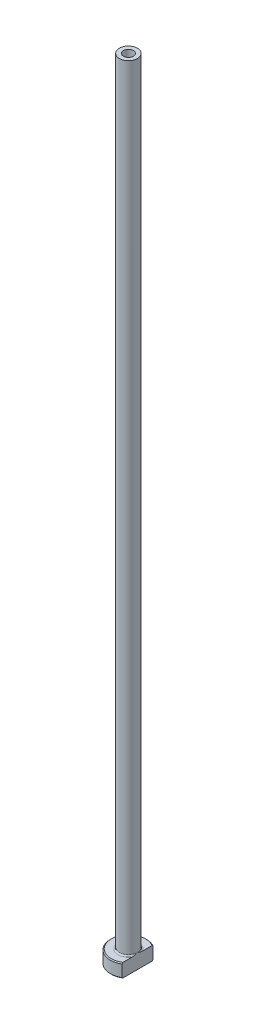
ISO-10303-21;
HEADER;
FILE_DESCRIPTION(('STEP AP214'),'2;1');
FILE_NAME('part.step','',(''),(''),'','','');
FILE_SCHEMA(('AUTOMOTIVE_DESIGN { 1 0 10303 214 1 1 1 1 }'));
ENDSEC;
DATA;
#1=APPLICATION_CONTEXT('core data for automotive mechanical design processes');
#2=APPLICATION_PROTOCOL_DEFINITION('international standard','automotive_design',2000,#1);
#3=PRODUCT_CONTEXT('',#1,'mechanical');
#4=PRODUCT('Part','Part','',(#3));
#5=PRODUCT_RELATED_PRODUCT_CATEGORY('part','',(#4));
#6=PRODUCT_DEFINITION_FORMATION('','',#4);
#7=PRODUCT_DEFINITION_CONTEXT('part definition',#1,'design');
#8=PRODUCT_DEFINITION('design','',#6,#7);
#9=PRODUCT_DEFINITION_SHAPE('','',#8);
#10=(LENGTH_UNIT() NAMED_UNIT(*) SI_UNIT(.MILLI.,.METRE.));
#11=(NAMED_UNIT(*) PLANE_ANGLE_UNIT() SI_UNIT($,.RADIAN.));
#12=(NAMED_UNIT(*) SI_UNIT($,.STERADIAN.) SOLID_ANGLE_UNIT());
#13=UNCERTAINTY_MEASURE_WITH_UNIT(LENGTH_MEASURE(1.E-05),#10,'distance_accuracy_value','');
#14=(GEOMETRIC_REPRESENTATION_CONTEXT(3) GLOBAL_UNCERTAINTY_ASSIGNED_CONTEXT((#13)) GLOBAL_UNIT_ASSIGNED_CONTEXT((#10,
#11,#12)) REPRESENTATION_CONTEXT('',''));
#15=CARTESIAN_POINT('',(0.,0.,0.));
#16=DIRECTION('',(0.,0.,1.));
#17=DIRECTION('',(1.,0.,0.));
#18=AXIS2_PLACEMENT_3D('',#15,#16,#17);
#19=CARTESIAN_POINT('',(0.,92.1876809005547,0.));
#20=DIRECTION('',(0.,1.,0.));
#21=DIRECTION('',(0.,0.,1.));
#22=AXIS2_PLACEMENT_3D('',#19,#20,#21);
#23=CYLINDRICAL_SURFACE('',#22,1.1);
#24=CARTESIAN_POINT('',(0.,175.,0.));
#25=DIRECTION('',(0.,1.,0.));
#26=DIRECTION('',(0.,0.,1.));
#27=AXIS2_PLACEMENT_3D('',#24,#25,#26);
#28=CIRCLE('',#27,1.1);
#29=CARTESIAN_POINT('',(0.,175.,1.1));
#30=VERTEX_POINT('',#29);
#31=EDGE_CURVE('E167',#30,#30,#28,.T.);
#32=ORIENTED_EDGE('',*,*,#31,.T.);
#33=EDGE_LOOP('',(#32));
#34=FACE_BOUND('',#33,.T.);
#35=CARTESIAN_POINT('',(0.,140.,0.));
#36=DIRECTION('',(0.,1.,0.));
#37=DIRECTION('',(0.,0.,1.));
#38=AXIS2_PLACEMENT_3D('',#35,#36,#37);
#39=CIRCLE('',#38,1.1);
#40=CARTESIAN_POINT('',(0.,140.,1.1));
#41=VERTEX_POINT('',#40);
#42=EDGE_CURVE('E170',#41,#41,#39,.T.);
#43=ORIENTED_EDGE('',*,*,#42,.F.);
#44=EDGE_LOOP('',(#43));
#45=FACE_BOUND('',#44,.T.);
#46=ADVANCED_FACE('F32',(#34,#45),#23,.F.);
#47=CARTESIAN_POINT('',(-1.1,175.,0.));
#48=DIRECTION('',(0.,1.,0.));
#49=DIRECTION('',(0.,0.,1.));
#50=AXIS2_PLACEMENT_3D('',#47,#48,#49);
#51=PLANE('',#50);
#52=CARTESIAN_POINT('',(0.,175.,0.));
#53=DIRECTION('',(0.,1.,0.));
#54=DIRECTION('',(0.,0.,1.));
#55=AXIS2_PLACEMENT_3D('',#52,#53,#54);
#56=CIRCLE('',#55,2.00000000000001);
#57=CARTESIAN_POINT('',(0.,175.,2.00000000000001));
#58=VERTEX_POINT('',#57);
#59=EDGE_CURVE('E174',#58,#58,#56,.T.);
#60=ORIENTED_EDGE('',*,*,#59,.T.);
#61=EDGE_LOOP('',(#60));
#62=FACE_BOUND('',#61,.T.);
#63=ORIENTED_EDGE('',*,*,#31,.F.);
#64=EDGE_LOOP('',(#63));
#65=FACE_BOUND('',#64,.T.);
#66=ADVANCED_FACE('F157',(#62,#65),#51,.T.);
#67=CARTESIAN_POINT('',(0.,92.1876809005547,0.));
#68=DIRECTION('',(0.,1.,0.));
#69=DIRECTION('',(0.,0.,1.));
#70=AXIS2_PLACEMENT_3D('',#67,#68,#69);
#71=CYLINDRICAL_SURFACE('',#70,2.);
#72=CARTESIAN_POINT('',(0.,3.3,0.));
#73=DIRECTION('',(0.,1.,0.));
#74=DIRECTION('',(0.,0.,1.));
#75=AXIS2_PLACEMENT_3D('',#72,#73,#74);
#76=CIRCLE('',#75,2.);
#77=CARTESIAN_POINT('',(2.,3.3,0.));
#78=VERTEX_POINT('',#77);
#79=EDGE_CURVE('E180',#78,#78,#76,.T.);
#80=ORIENTED_EDGE('',*,*,#79,.T.);
#81=EDGE_LOOP('',(#80));
#82=FACE_BOUND('',#81,.T.);
#83=ORIENTED_EDGE('',*,*,#59,.F.);
#84=EDGE_LOOP('',(#83));
#85=FACE_BOUND('',#84,.T.);
#86=ADVANCED_FACE('F162',(#82,#85),#71,.T.);
#87=CARTESIAN_POINT('',(-1.99999999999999,3.,0.));
#88=DIRECTION('',(0.,1.,0.));
#89=DIRECTION('',(0.,0.,1.));
#90=AXIS2_PLACEMENT_3D('',#87,#88,#89);
#91=PLANE('',#90);
#92=DIRECTION('',(0.,0.,1.));
#93=VECTOR('',#92,1.);
#94=CARTESIAN_POINT('',(2.,3.,0.));
#95=LINE('',#94,#93);
#96=CARTESIAN_POINT('',(2.,3.,-3.23109888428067));
#97=VERTEX_POINT('',#96);
#98=CARTESIAN_POINT('',(2.,3.,-1.13578166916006));
#99=VERTEX_POINT('',#98);
#100=EDGE_CURVE('E54',#97,#99,#95,.T.);
#101=ORIENTED_EDGE('',*,*,#100,.F.);
#102=CARTESIAN_POINT('',(0.,3.,0.));
#103=DIRECTION('',(0.,1.,0.));
#104=DIRECTION('',(0.,0.,1.));
#105=AXIS2_PLACEMENT_3D('',#102,#103,#104);
#106=CIRCLE('',#105,3.79999999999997);
#107=CARTESIAN_POINT('',(1.99999999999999,2.99999999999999,3.23109888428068));
#108=VERTEX_POINT('',#107);
#109=EDGE_CURVE('E186',#97,#108,#106,.T.);
#110=ORIENTED_EDGE('',*,*,#109,.T.);
#111=CARTESIAN_POINT('',(2.,3.,1.13578166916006));
#112=VERTEX_POINT('',#111);
#113=EDGE_CURVE('E134',#112,#108,#95,.T.);
#114=ORIENTED_EDGE('',*,*,#113,.F.);
#115=CARTESIAN_POINT('',(0.,3.,0.));
#116=DIRECTION('',(0.,1.,0.));
#117=DIRECTION('',(0.,0.,1.));
#118=AXIS2_PLACEMENT_3D('',#115,#116,#117);
#119=CIRCLE('',#118,2.3);
#120=EDGE_CURVE('E183',#112,#99,#119,.F.);
#121=ORIENTED_EDGE('',*,*,#120,.T.);
#122=EDGE_LOOP('',(#101,#110,#114,#121));
#123=FACE_BOUND('',#122,.T.);
#124=ADVANCED_FACE('F197',(#123),#91,.T.);
#125=CARTESIAN_POINT('',(0.,92.1876809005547,0.));
#126=DIRECTION('',(0.,1.,0.));
#127=DIRECTION('',(0.,0.,1.));
#128=AXIS2_PLACEMENT_3D('',#125,#126,#127);
#129=CYLINDRICAL_SURFACE('',#128,3.99999999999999);
#130=DIRECTION('',(0.,-1.,0.));
#131=VECTOR('',#130,1.);
#132=CARTESIAN_POINT('',(1.99999999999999,175.,3.46410161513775));
#133=LINE('',#132,#131);
#134=CARTESIAN_POINT('',(1.99999999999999,2.79999999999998,3.46410161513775));
#135=VERTEX_POINT('',#134);
#136=CARTESIAN_POINT('',(1.99999999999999,0.199999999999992,3.46410161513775));
#137=VERTEX_POINT('',#136);
#138=EDGE_CURVE('E82',#135,#137,#133,.T.);
#139=ORIENTED_EDGE('',*,*,#138,.F.);
#140=CARTESIAN_POINT('',(0.,2.79999999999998,0.));
#141=DIRECTION('',(0.,1.,0.));
#142=DIRECTION('',(0.,0.,1.));
#143=AXIS2_PLACEMENT_3D('',#140,#141,#142);
#144=CIRCLE('',#143,3.99999999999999);
#145=CARTESIAN_POINT('',(2.,2.79999999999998,-3.46410161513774));
#146=VERTEX_POINT('',#145);
#147=EDGE_CURVE('E95',#135,#146,#144,.F.);
#148=ORIENTED_EDGE('',*,*,#147,.T.);
#149=DIRECTION('',(0.,-1.,0.));
#150=VECTOR('',#149,1.);
#151=CARTESIAN_POINT('',(2.,175.,-3.46410161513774));
#152=LINE('',#151,#150);
#153=CARTESIAN_POINT('',(2.,0.199999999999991,-3.46410161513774));
#154=VERTEX_POINT('',#153);
#155=EDGE_CURVE('E192',#146,#154,#152,.T.);
#156=ORIENTED_EDGE('',*,*,#155,.T.);
#157=CARTESIAN_POINT('',(0.,0.199999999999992,0.));
#158=DIRECTION('',(0.,-1.,0.));
#159=DIRECTION('',(0.,0.,-1.));
#160=AXIS2_PLACEMENT_3D('',#157,#158,#159);
#161=CIRCLE('',#160,3.99999999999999);
#162=EDGE_CURVE('E98',#154,#137,#161,.F.);
#163=ORIENTED_EDGE('',*,*,#162,.T.);
#164=EDGE_LOOP('',(#139,#148,#156,#163));
#165=FACE_BOUND('',#164,.T.);
#166=ADVANCED_FACE('F190',(#165),#129,.T.);
#167=CARTESIAN_POINT('',(-3.99999999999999,0.,0.));
#168=DIRECTION('',(0.,-1.,0.));
#169=DIRECTION('',(0.,0.,-1.));
#170=AXIS2_PLACEMENT_3D('',#167,#168,#169);
#171=PLANE('',#170);
#172=CARTESIAN_POINT('',(0.,0.,0.));
#173=DIRECTION('',(0.,-1.,0.));
#174=DIRECTION('',(0.,0.,-1.));
#175=AXIS2_PLACEMENT_3D('',#172,#173,#174);
#176=CIRCLE('',#175,1.84999999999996);
#177=CARTESIAN_POINT('',(0.,0.,-1.84999999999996));
#178=VERTEX_POINT('',#177);
#179=EDGE_CURVE('E40',#178,#178,#176,.F.);
#180=ORIENTED_EDGE('',*,*,#179,.T.);
#181=EDGE_LOOP('',(#180));
#182=FACE_BOUND('',#181,.T.);
#183=DIRECTION('',(0.,0.,-1.));
#184=VECTOR('',#183,1.);
#185=CARTESIAN_POINT('',(1.99999999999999,0.,3.46410161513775));
#186=LINE('',#185,#184);
#187=CARTESIAN_POINT('',(1.99999999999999,0.,3.2310988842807));
#188=VERTEX_POINT('',#187);
#189=CARTESIAN_POINT('',(1.99999999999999,0.,-3.2310988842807));
#190=VERTEX_POINT('',#189);
#191=EDGE_CURVE('E47',#188,#190,#186,.T.);
#192=ORIENTED_EDGE('',*,*,#191,.F.);
#193=CARTESIAN_POINT('',(0.,0.,0.));
#194=DIRECTION('',(0.,-1.,0.));
#195=DIRECTION('',(0.,0.,-1.));
#196=AXIS2_PLACEMENT_3D('',#193,#194,#195);
#197=CIRCLE('',#196,3.8);
#198=EDGE_CURVE('E92',#188,#190,#197,.T.);
#199=ORIENTED_EDGE('',*,*,#198,.T.);
#200=EDGE_LOOP('',(#192,#199));
#201=FACE_BOUND('',#200,.T.);
#202=ADVANCED_FACE('F91',(#182,#201),#171,.T.);
#203=CARTESIAN_POINT('',(0.,92.1876809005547,0.));
#204=DIRECTION('',(0.,1.,0.));
#205=DIRECTION('',(0.,0.,1.));
#206=AXIS2_PLACEMENT_3D('',#203,#204,#205);
#207=CYLINDRICAL_SURFACE('',#206,1.35);
#208=CARTESIAN_POINT('',(0.,0.499999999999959,0.));
#209=DIRECTION('',(0.,-1.,0.));
#210=DIRECTION('',(0.,0.,-1.));
#211=AXIS2_PLACEMENT_3D('',#208,#209,#210);
#212=CIRCLE('',#211,1.35);
#213=CARTESIAN_POINT('',(0.,0.499999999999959,-1.35));
#214=VERTEX_POINT('',#213);
#215=EDGE_CURVE('E11',#214,#214,#212,.T.);
#216=ORIENTED_EDGE('',*,*,#215,.T.);
#217=EDGE_LOOP('',(#216));
#218=FACE_BOUND('',#217,.T.);
#219=CARTESIAN_POINT('',(0.,128.,0.));
#220=DIRECTION('',(0.,1.,0.));
#221=DIRECTION('',(0.,0.,1.));
#222=AXIS2_PLACEMENT_3D('',#219,#220,#221);
#223=CIRCLE('',#222,1.35000000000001);
#224=CARTESIAN_POINT('',(0.,128.,1.35000000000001));
#225=VERTEX_POINT('',#224);
#226=EDGE_CURVE('E172',#225,#225,#223,.T.);
#227=ORIENTED_EDGE('',*,*,#226,.T.);
#228=EDGE_LOOP('',(#227));
#229=FACE_BOUND('',#228,.T.);
#230=ADVANCED_FACE('F215',(#218,#229),#207,.F.);
#231=CARTESIAN_POINT('',(0.,128.,0.));
#232=DIRECTION('',(0.,-1.,0.));
#233=DIRECTION('',(0.,0.,-1.));
#234=AXIS2_PLACEMENT_3D('',#231,#232,#233);
#235=CONICAL_SURFACE('',#234,1.35000000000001,0.0208303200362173);
#236=ORIENTED_EDGE('',*,*,#42,.T.);
#237=EDGE_LOOP('',(#236));
#238=FACE_BOUND('',#237,.T.);
#239=ORIENTED_EDGE('',*,*,#226,.F.);
#240=EDGE_LOOP('',(#239));
#241=FACE_BOUND('',#240,.T.);
#242=ADVANCED_FACE('F111',(#238,#241),#235,.F.);
#243=CARTESIAN_POINT('',(0.,3.3,0.));
#244=DIRECTION('',(0.,1.,0.));
#245=DIRECTION('',(0.,0.,1.));
#246=AXIS2_PLACEMENT_3D('',#243,#244,#245);
#247=TOROIDAL_SURFACE('',#246,2.3,0.3);
#248=ORIENTED_EDGE('',*,*,#120,.F.);
#249=CARTESIAN_POINT('',(2.,3.3,0.));
#250=CARTESIAN_POINT('',(2.,3.30000062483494,7.91123605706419E-11));
#251=CARTESIAN_POINT('',(2.,3.30000124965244,1.38466997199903E-07));
#252=CARTESIAN_POINT('',(2.,3.30000244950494,5.72507176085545E-07));
#253=CARTESIAN_POINT('',(2.,3.30000302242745,8.72849095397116E-07));
#254=CARTESIAN_POINT('',(2.,3.30000416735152,1.59335962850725E-06));
#255=CARTESIAN_POINT('',(2.,3.30000473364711,2.02244720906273E-06));
#256=CARTESIAN_POINT('',(2.,3.30000579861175,2.94494879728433E-06));
#257=CARTESIAN_POINT('',(2.,3.3000062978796,3.43770345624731E-06));
#258=CARTESIAN_POINT('',(2.,3.30000798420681,5.21460127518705E-06));
#259=CARTESIAN_POINT('',(2.,3.30000908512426,6.58180978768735E-06));
#260=CARTESIAN_POINT('',(2.,3.30001103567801,9.39775405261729E-06));
#261=CARTESIAN_POINT('',(2.,3.30001189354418,1.08411109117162E-05));
#262=CARTESIAN_POINT('',(2.,3.30001514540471,1.65122788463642E-05));
#263=CARTESIAN_POINT('',(2.,3.30001737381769,2.08398799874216E-05));
#264=CARTESIAN_POINT('',(2.,3.30002099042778,2.93440784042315E-05));
#265=CARTESIAN_POINT('',(2.,3.30002243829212,3.34960317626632E-05));
#266=CARTESIAN_POINT('',(2.,3.30002863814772,5.12890605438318E-05));
#267=CARTESIAN_POINT('',(2.,3.30003337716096,6.49250980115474E-05));
#268=CARTESIAN_POINT('',(2.,3.30004093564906,9.03829878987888E-05));
#269=CARTESIAN_POINT('',(2.,3.30004394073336,0.000102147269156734));
#270=CARTESIAN_POINT('',(1.99999999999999,3.3000678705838,0.000188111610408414));
#271=CARTESIAN_POINT('',(1.99999999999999,3.30009855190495,0.000259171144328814));
#272=CARTESIAN_POINT('',(2.,3.30021378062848,0.000536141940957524));
#273=CARTESIAN_POINT('',(2.,3.30029106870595,0.000744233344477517));
#274=CARTESIAN_POINT('',(1.99999999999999,3.30059644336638,0.00155446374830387));
#275=CARTESIAN_POINT('',(1.99999999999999,3.30083214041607,0.00215436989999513));
#276=CARTESIAN_POINT('',(2.,3.30179425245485,0.00461477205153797));
#277=CARTESIAN_POINT('',(2.,3.30251207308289,0.00647773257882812));
#278=CARTESIAN_POINT('',(1.99999999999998,3.3131163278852,0.0339840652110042));
#279=CARTESIAN_POINT('',(1.99999999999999,3.32306890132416,0.0596088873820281));
#280=CARTESIAN_POINT('',(2.,3.34248629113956,0.109946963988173));
#281=CARTESIAN_POINT('',(2.,3.35195547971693,0.134658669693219));
#282=CARTESIAN_POINT('',(1.99999999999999,3.37186796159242,0.187046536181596));
#283=CARTESIAN_POINT('',(1.99999999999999,3.38229466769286,0.214729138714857));
#284=CARTESIAN_POINT('',(2.,3.4029770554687,0.270480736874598));
#285=CARTESIAN_POINT('',(2.,3.41322989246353,0.298550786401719));
#286=CARTESIAN_POINT('',(2.,3.43806738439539,0.36800773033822));
#287=CARTESIAN_POINT('',(2.,3.4524318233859,0.409474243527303));
#288=CARTESIAN_POINT('',(2.,3.47965482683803,0.491807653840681));
#289=CARTESIAN_POINT('',(2.,3.49254110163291,0.532665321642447));
#290=CARTESIAN_POINT('',(2.,3.51851192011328,0.620554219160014));
#291=CARTESIAN_POINT('',(2.,3.53137383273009,0.667652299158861));
#292=CARTESIAN_POINT('',(2.,3.55459547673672,0.762854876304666));
#293=CARTESIAN_POINT('',(2.,3.56493539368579,0.810964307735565));
#294=CARTESIAN_POINT('',(2.,3.5827095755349,0.910933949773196));
#295=CARTESIAN_POINT('',(2.,3.58991426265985,0.96283643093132));
#296=CARTESIAN_POINT('',(2.,3.59906919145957,1.0669840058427));
#297=CARTESIAN_POINT('',(2.,3.60103790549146,1.11922724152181));
#298=CARTESIAN_POINT('',(2.,3.59819318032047,1.21399009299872));
#299=CARTESIAN_POINT('',(2.,3.5945554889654,1.25653871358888));
#300=CARTESIAN_POINT('',(2.,3.58116512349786,1.34017723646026));
#301=CARTESIAN_POINT('',(2.,3.57150205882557,1.3812793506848));
#302=CARTESIAN_POINT('',(2.,3.55087659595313,1.44109771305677));
#303=CARTESIAN_POINT('',(2.,3.542912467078,1.46084510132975));
#304=CARTESIAN_POINT('',(2.,3.52453399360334,1.49924523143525));
#305=CARTESIAN_POINT('',(2.,3.51411538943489,1.51789599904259));
#306=CARTESIAN_POINT('',(2.,3.49255299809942,1.55022658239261));
#307=CARTESIAN_POINT('',(2.,3.48185951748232,1.56420357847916));
#308=CARTESIAN_POINT('',(2.,3.45839348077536,1.59028758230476));
#309=CARTESIAN_POINT('',(2.,3.44562585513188,1.60239889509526));
#310=CARTESIAN_POINT('',(2.,3.42183279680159,1.62093425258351));
#311=CARTESIAN_POINT('',(2.,3.41131183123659,1.62800294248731));
#312=CARTESIAN_POINT('',(2.,3.38926242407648,1.64036132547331));
#313=CARTESIAN_POINT('',(2.,3.37773458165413,1.64565206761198));
#314=CARTESIAN_POINT('',(2.,3.35379760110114,1.6541096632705));
#315=CARTESIAN_POINT('',(2.,3.34138166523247,1.65725762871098));
#316=CARTESIAN_POINT('',(2.,3.31617371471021,1.66106000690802));
#317=CARTESIAN_POINT('',(2.,3.3033820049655,1.66171638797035));
#318=CARTESIAN_POINT('',(2.,3.27959278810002,1.66055848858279));
#319=CARTESIAN_POINT('',(2.,3.2685787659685,1.6590551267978));
#320=CARTESIAN_POINT('',(2.,3.24695777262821,1.65423593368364));
#321=CARTESIAN_POINT('',(2.,3.23635086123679,1.65091983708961));
#322=CARTESIAN_POINT('',(2.,3.2156689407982,1.64264699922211));
#323=CARTESIAN_POINT('',(2.,3.20560117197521,1.63767239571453));
#324=CARTESIAN_POINT('',(2.,3.18626855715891,1.62636415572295));
#325=CARTESIAN_POINT('',(2.,3.17700400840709,1.62003001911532));
#326=CARTESIAN_POINT('',(2.,3.154299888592,1.60233802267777));
#327=CARTESIAN_POINT('',(2.,3.14148777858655,1.59017362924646));
#328=CARTESIAN_POINT('',(2.,3.11794267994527,1.56396532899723));
#329=CARTESIAN_POINT('',(2.,3.10721625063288,1.54991572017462));
#330=CARTESIAN_POINT('',(2.,3.08234423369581,1.51253200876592));
#331=CARTESIAN_POINT('',(2.,3.06952968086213,1.48831711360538));
#332=CARTESIAN_POINT('',(2.,3.0477395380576,1.4383202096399));
#333=CARTESIAN_POINT('',(2.,3.03876197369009,1.41253901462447));
#334=CARTESIAN_POINT('',(2.,3.01850750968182,1.34101817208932));
#335=CARTESIAN_POINT('',(2.,3.01031623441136,1.29441496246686));
#336=CARTESIAN_POINT('',(2.,3.00061264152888,1.19993212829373));
#337=CARTESIAN_POINT('',(2.,2.99920833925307,1.15204398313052));
#338=CARTESIAN_POINT('',(2.,3.00193088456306,1.04246961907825));
#339=CARTESIAN_POINT('',(2.,3.00779200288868,0.980836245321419));
#340=CARTESIAN_POINT('',(2.,3.02562921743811,0.858294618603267));
#341=CARTESIAN_POINT('',(2.,3.03763032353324,0.797390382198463));
#342=CARTESIAN_POINT('',(2.,3.06494905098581,0.681046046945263));
#343=CARTESIAN_POINT('',(2.,3.07996031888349,0.625531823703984));
#344=CARTESIAN_POINT('',(2.,3.11250087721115,0.515805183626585));
#345=CARTESIAN_POINT('',(2.,3.13000629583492,0.461585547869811));
#346=CARTESIAN_POINT('',(2.,3.15814737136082,0.379074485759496));
#347=CARTESIAN_POINT('',(2.,3.16814918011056,0.350562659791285));
#348=CARTESIAN_POINT('',(2.,3.1887976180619,0.29295407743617));
#349=CARTESIAN_POINT('',(2.,3.19945417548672,0.263860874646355));
#350=CARTESIAN_POINT('',(2.,3.21767622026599,0.214869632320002));
#351=CARTESIAN_POINT('',(2.,3.22516548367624,0.194943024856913));
#352=CARTESIAN_POINT('',(2.,3.24017206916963,0.155327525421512));
#353=CARTESIAN_POINT('',(1.99999999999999,3.24768836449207,0.135638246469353));
#354=CARTESIAN_POINT('',(2.,3.26198776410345,0.0983447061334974));
#355=CARTESIAN_POINT('',(2.,3.26876515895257,0.0807381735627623));
#356=CARTESIAN_POINT('',(1.99999999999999,3.28263254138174,0.044871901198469));
#357=CARTESIAN_POINT('',(1.99999999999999,3.28972459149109,0.0266128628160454));
#358=CARTESIAN_POINT('',(2.,3.29748742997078,0.00647923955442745));
#359=CARTESIAN_POINT('',(2.,3.2982046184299,0.00461774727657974));
#360=CARTESIAN_POINT('',(1.99999999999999,3.29916656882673,0.00215769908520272));
#361=CARTESIAN_POINT('',(1.99999999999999,3.29940270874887,0.00155667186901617));
#362=CARTESIAN_POINT('',(2.,3.29970861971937,0.000745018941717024));
#363=CARTESIAN_POINT('',(2.,3.29978601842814,0.000536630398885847));
#364=CARTESIAN_POINT('',(1.99999999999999,3.29990139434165,0.000259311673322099));
#365=CARTESIAN_POINT('',(1.99999999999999,3.29993209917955,0.000188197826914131));
#366=CARTESIAN_POINT('',(2.,3.29995604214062,0.000102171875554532));
#367=CARTESIAN_POINT('',(2.,3.29995904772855,9.04035996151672E-05));
#368=CARTESIAN_POINT('',(2.,3.29996660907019,6.49368804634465E-05));
#369=CARTESIAN_POINT('',(2.,3.29997135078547,5.12961162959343E-05));
#370=CARTESIAN_POINT('',(2.,3.29997755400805,3.34977869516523E-05));
#371=CARTESIAN_POINT('',(2.,3.29997900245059,2.93452199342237E-05));
#372=CARTESIAN_POINT('',(2.,3.29998262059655,2.08398584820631E-05));
#373=CARTESIAN_POINT('',(2.,3.29998485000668,1.65117311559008E-05));
#374=CARTESIAN_POINT('',(2.,3.29998810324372,1.08400644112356E-05));
#375=CARTESIAN_POINT('',(2.,3.29998896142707,9.39665984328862E-06));
#376=CARTESIAN_POINT('',(2.,3.29999091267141,6.58068255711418E-06));
#377=CARTESIAN_POINT('',(2.,3.29999201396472,5.21349217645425E-06));
#378=CARTESIAN_POINT('',(2.,3.29999370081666,3.43669373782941E-06));
#379=CARTESIAN_POINT('',(2.,3.29999420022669,2.94398263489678E-06));
#380=CARTESIAN_POINT('',(2.,3.29999526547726,2.0215936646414E-06));
#381=CARTESIAN_POINT('',(2.,3.29999583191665,1.59257546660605E-06));
#382=CARTESIAN_POINT('',(2.,3.2999969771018,8.7223252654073E-07));
#383=CARTESIAN_POINT('',(2.,3.29999755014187,5.71985157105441E-07));
#384=CARTESIAN_POINT('',(2.,3.29999875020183,1.38175067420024E-07));
#385=CARTESIAN_POINT('',(2.,3.29999937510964,-7.91188757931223E-11));
#386=CARTESIAN_POINT('',(2.,3.3,0.));
#387=B_SPLINE_CURVE_WITH_KNOTS('',3,(#249,#250,#251,#252,#253,#254,#255,#256,#257,#258,#259,
#260,#261,#262,#263,#264,#265,#266,#267,#268,#269,#270,#271,#272,#273,#274,#275,#276,#277,#278,
#279,#280,#281,#282,#283,#284,#285,#286,#287,#288,#289,#290,#291,#292,#293,#294,#295,#296,#297,
#298,#299,#300,#301,#302,#303,#304,#305,#306,#307,#308,#309,#310,#311,#312,#313,#314,#315,#316,
#317,#318,#319,#320,#321,#322,#323,#324,#325,#326,#327,#328,#329,#330,#331,#332,#333,#334,#335,
#336,#337,#338,#339,#340,#341,#342,#343,#344,#345,#346,#347,#348,#349,#350,#351,#352,#353,#354,
#355,#356,#357,#358,#359,#360,#361,#362,#363,#364,#365,#366,#367,#368,#369,#370,#371,#372,#373,
#374,#375,#376,#377,#378,#379,#380,#381,#382,#383,#384,#385,#386),.UNSPECIFIED.,.T.,.F.,(4,2,2,
2,2,2,2,2,2,2,2,2,2,2,2,2,2,2,2,2,2,2,2,2,2,2,2,2,2,2,2,2,2,2,2,2,2,2,2,2,2,2,2,2,2,2,2,2,2,2,2,
2,2,2,2,2,2,2,2,2,2,2,2,2,2,2,2,2,4),(0.,1.8739220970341E-06,3.80527330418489E-06,
5.92782108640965E-06,8.02992601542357E-06,1.32707932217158E-05,1.8303945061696E-05,
3.28629488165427E-05,4.60403082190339E-05,8.93409859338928E-05,0.000125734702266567,
0.000357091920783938,0.00102372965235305,0.00295649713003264,0.00894682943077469,
0.091407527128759,0.170800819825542,0.259542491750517,0.349192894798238,0.480831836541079,
0.609336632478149,0.755749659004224,0.903278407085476,1.06029304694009,1.21675300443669,
1.34456674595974,1.47052354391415,1.53427785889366,1.59814364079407,1.65076980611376,
1.70327265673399,1.74115950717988,1.77902396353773,1.81721800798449,1.85538187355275,
1.8885707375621,1.92176445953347,1.95532789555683,1.98890369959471,2.04160283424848,
2.09446511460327,2.17619131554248,2.25787541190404,2.39903747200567,2.54243890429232,
2.72770087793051,2.91372355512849,3.08615579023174,3.25703652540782,3.34768022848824,
3.44062797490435,3.50449043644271,3.56771526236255,3.62431442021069,3.68307253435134,
3.68905809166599,3.69099447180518,3.69166206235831,3.69189359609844,3.69193000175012,
3.69197331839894,3.69198649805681,3.69200105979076,3.6920060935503,3.69201133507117,
3.69201343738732,3.6920155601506,3.69201749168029,3.69201936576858),.UNSPECIFIED.);
#388=EDGE_CURVE('E126',#112,#78,#387,.T.);
#389=ORIENTED_EDGE('',*,*,#388,.T.);
#390=ORIENTED_EDGE('',*,*,#79,.F.);
#391=CARTESIAN_POINT('',(2.,3.3,0.));
#392=CARTESIAN_POINT('',(2.,3.29999937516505,-7.91119661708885E-11));
#393=CARTESIAN_POINT('',(2.,3.29999875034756,-1.38466996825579E-07));
#394=CARTESIAN_POINT('',(2.,3.29999755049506,-5.72507175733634E-07));
#395=CARTESIAN_POINT('',(2.,3.29999697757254,-8.72849095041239E-07));
#396=CARTESIAN_POINT('',(2.,3.29999583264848,-1.59335962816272E-06));
#397=CARTESIAN_POINT('',(2.,3.29999526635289,-2.02244720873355E-06));
#398=CARTESIAN_POINT('',(2.,3.29999420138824,-2.94494879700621E-06));
#399=CARTESIAN_POINT('',(2.,3.29999370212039,-3.4377034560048E-06));
#400=CARTESIAN_POINT('',(2.,3.29999201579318,-5.21460127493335E-06));
#401=CARTESIAN_POINT('',(2.,3.29999091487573,-6.58180978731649E-06));
#402=CARTESIAN_POINT('',(2.,3.29998896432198,-9.39775405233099E-06));
#403=CARTESIAN_POINT('',(2.,3.29998810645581,-1.08411109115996E-05));
#404=CARTESIAN_POINT('',(2.,3.29998485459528,-1.65122788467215E-05));
#405=CARTESIAN_POINT('',(2.,3.2999826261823,-2.08398799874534E-05));
#406=CARTESIAN_POINT('',(2.,3.29997900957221,-2.93440784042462E-05));
#407=CARTESIAN_POINT('',(2.,3.29997756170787,-3.34960317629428E-05));
#408=CARTESIAN_POINT('',(2.,3.29997136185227,-5.12890605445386E-05));
#409=CARTESIAN_POINT('',(2.,3.29996662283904,-6.4925098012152E-05));
#410=CARTESIAN_POINT('',(2.,3.29995906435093,-9.03829878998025E-05));
#411=CARTESIAN_POINT('',(2.,3.29995605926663,-0.000102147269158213));
#412=CARTESIAN_POINT('',(1.99999999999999,3.29993212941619,-0.000188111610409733));
#413=CARTESIAN_POINT('',(1.99999999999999,3.29990144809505,-0.000259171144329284));
#414=CARTESIAN_POINT('',(2.,3.29978621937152,-0.00053614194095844));
#415=CARTESIAN_POINT('',(2.,3.29970893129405,-0.000744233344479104));
#416=CARTESIAN_POINT('',(1.99999999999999,3.29940355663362,-0.00155446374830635));
#417=CARTESIAN_POINT('',(1.99999999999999,3.29916785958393,-0.00215436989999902));
#418=CARTESIAN_POINT('',(2.,3.29820574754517,-0.00461477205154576));
#419=CARTESIAN_POINT('',(2.,3.29748792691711,-0.00647773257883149));
#420=CARTESIAN_POINT('',(1.99999999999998,3.28688367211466,-0.0339840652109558));
#421=CARTESIAN_POINT('',(1.99999999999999,3.2769310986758,-0.0596088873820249));
#422=CARTESIAN_POINT('',(2.,3.25751370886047,-0.109946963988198));
#423=CARTESIAN_POINT('',(2.,3.24804452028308,-0.13465866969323));
#424=CARTESIAN_POINT('',(1.99999999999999,3.22813203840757,-0.187046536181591));
#425=CARTESIAN_POINT('',(1.99999999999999,3.21770533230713,-0.214729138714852));
#426=CARTESIAN_POINT('',(2.,3.1970229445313,-0.270480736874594));
#427=CARTESIAN_POINT('',(2.,3.18677010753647,-0.298550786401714));
#428=CARTESIAN_POINT('',(2.,3.1619326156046,-0.368007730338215));
#429=CARTESIAN_POINT('',(2.,3.1475681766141,-0.409474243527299));
#430=CARTESIAN_POINT('',(2.,3.12034517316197,-0.491807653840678));
#431=CARTESIAN_POINT('',(2.,3.10745889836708,-0.532665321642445));
#432=CARTESIAN_POINT('',(2.,3.08148807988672,-0.620554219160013));
#433=CARTESIAN_POINT('',(2.,3.0686261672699,-0.667652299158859));
#434=CARTESIAN_POINT('',(2.,3.04540452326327,-0.762854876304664));
#435=CARTESIAN_POINT('',(2.,3.0350646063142,-0.810964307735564));
#436=CARTESIAN_POINT('',(2.,3.01729042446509,-0.910933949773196));
#437=CARTESIAN_POINT('',(2.,3.01008573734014,-0.96283643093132));
#438=CARTESIAN_POINT('',(2.,3.00093080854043,-1.0669840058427));
#439=CARTESIAN_POINT('',(2.,2.99896209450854,-1.11922724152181));
#440=CARTESIAN_POINT('',(2.,3.00180681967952,-1.21399009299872));
#441=CARTESIAN_POINT('',(2.,3.00544451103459,-1.25653871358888));
#442=CARTESIAN_POINT('',(2.,3.01883487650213,-1.34017723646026));
#443=CARTESIAN_POINT('',(2.,3.02849794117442,-1.3812793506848));
#444=CARTESIAN_POINT('',(2.,3.04912340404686,-1.44109771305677));
#445=CARTESIAN_POINT('',(2.,3.05708753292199,-1.46084510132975));
#446=CARTESIAN_POINT('',(2.,3.07546600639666,-1.49924523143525));
#447=CARTESIAN_POINT('',(2.,3.08588461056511,-1.51789599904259));
#448=CARTESIAN_POINT('',(2.,3.10744700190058,-1.55022658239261));
#449=CARTESIAN_POINT('',(2.,3.11814048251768,-1.56420357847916));
#450=CARTESIAN_POINT('',(2.,3.14160651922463,-1.59028758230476));
#451=CARTESIAN_POINT('',(2.,3.15437414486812,-1.60239889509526));
#452=CARTESIAN_POINT('',(2.,3.17816720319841,-1.62093425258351));
#453=CARTESIAN_POINT('',(2.,3.1886881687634,-1.62800294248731));
#454=CARTESIAN_POINT('',(2.,3.21073757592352,-1.64036132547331));
#455=CARTESIAN_POINT('',(2.,3.22226541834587,-1.64565206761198));
#456=CARTESIAN_POINT('',(2.,3.24620239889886,-1.6541096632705));
#457=CARTESIAN_POINT('',(2.,3.25861833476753,-1.65725762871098));
#458=CARTESIAN_POINT('',(2.,3.28382628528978,-1.66106000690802));
#459=CARTESIAN_POINT('',(2.,3.29661799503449,-1.66171638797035));
#460=CARTESIAN_POINT('',(2.,3.32040721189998,-1.66055848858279));
#461=CARTESIAN_POINT('',(2.,3.3314212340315,-1.6590551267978));
#462=CARTESIAN_POINT('',(2.,3.35304222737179,-1.65423593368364));
#463=CARTESIAN_POINT('',(2.,3.36364913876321,-1.65091983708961));
#464=CARTESIAN_POINT('',(2.,3.38433105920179,-1.64264699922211));
#465=CARTESIAN_POINT('',(2.,3.39439882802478,-1.63767239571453));
#466=CARTESIAN_POINT('',(2.,3.41373144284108,-1.62636415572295));
#467=CARTESIAN_POINT('',(2.,3.4229959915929,-1.62003001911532));
#468=CARTESIAN_POINT('',(2.,3.445700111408,-1.60233802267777));
#469=CARTESIAN_POINT('',(2.,3.45851222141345,-1.59017362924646));
#470=CARTESIAN_POINT('',(2.,3.48205732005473,-1.56396532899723));
#471=CARTESIAN_POINT('',(2.,3.49278374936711,-1.54991572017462));
#472=CARTESIAN_POINT('',(2.,3.51765576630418,-1.51253200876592));
#473=CARTESIAN_POINT('',(2.,3.53047031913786,-1.48831711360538));
#474=CARTESIAN_POINT('',(2.,3.55226046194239,-1.4383202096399));
#475=CARTESIAN_POINT('',(2.,3.5612380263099,-1.41253901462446));
#476=CARTESIAN_POINT('',(2.,3.58149249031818,-1.34101817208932));
#477=CARTESIAN_POINT('',(2.,3.58968376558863,-1.29441496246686));
#478=CARTESIAN_POINT('',(2.,3.59938735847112,-1.19993212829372));
#479=CARTESIAN_POINT('',(2.,3.60079166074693,-1.15204398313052));
#480=CARTESIAN_POINT('',(2.,3.59806911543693,-1.04246961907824));
#481=CARTESIAN_POINT('',(2.,3.59220799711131,-0.980836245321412));
#482=CARTESIAN_POINT('',(2.,3.57437078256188,-0.858294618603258));
#483=CARTESIAN_POINT('',(2.,3.56236967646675,-0.797390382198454));
#484=CARTESIAN_POINT('',(2.,3.53505094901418,-0.681046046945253));
#485=CARTESIAN_POINT('',(2.,3.52003968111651,-0.625531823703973));
#486=CARTESIAN_POINT('',(2.,3.48749912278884,-0.515805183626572));
#487=CARTESIAN_POINT('',(2.,3.46999370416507,-0.461585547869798));
#488=CARTESIAN_POINT('',(2.,3.44185262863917,-0.379074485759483));
#489=CARTESIAN_POINT('',(2.,3.43185081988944,-0.350562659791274));
#490=CARTESIAN_POINT('',(2.,3.41120238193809,-0.292954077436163));
#491=CARTESIAN_POINT('',(2.,3.40054582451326,-0.263860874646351));
#492=CARTESIAN_POINT('',(2.,3.38232377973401,-0.214869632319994));
#493=CARTESIAN_POINT('',(2.,3.37483451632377,-0.194943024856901));
#494=CARTESIAN_POINT('',(2.,3.35982793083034,-0.155327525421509));
#495=CARTESIAN_POINT('',(1.99999999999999,3.35231163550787,-0.135638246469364));
#496=CARTESIAN_POINT('',(2.,3.33801223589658,-0.0983447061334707));
#497=CARTESIAN_POINT('',(2.,3.33123484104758,-0.0807381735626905));
#498=CARTESIAN_POINT('',(1.99999999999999,3.31736745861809,-0.04487190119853));
#499=CARTESIAN_POINT('',(1.99999999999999,3.31027540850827,-0.0266128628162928));
#500=CARTESIAN_POINT('',(2.,3.30251257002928,-0.00647923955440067));
#501=CARTESIAN_POINT('',(2.,3.30179538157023,-0.00461774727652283));
#502=CARTESIAN_POINT('',(1.99999999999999,3.30083343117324,-0.00215769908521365));
#503=CARTESIAN_POINT('',(1.99999999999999,3.30059729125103,-0.00155667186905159));
#504=CARTESIAN_POINT('',(2.,3.30029138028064,-0.000745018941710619));
#505=CARTESIAN_POINT('',(2.,3.30021398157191,-0.000536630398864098));
#506=CARTESIAN_POINT('',(1.99999999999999,3.30009860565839,-0.000259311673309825));
#507=CARTESIAN_POINT('',(1.99999999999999,3.30006790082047,-0.000188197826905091));
#508=CARTESIAN_POINT('',(2.,3.30004395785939,-0.000102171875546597));
#509=CARTESIAN_POINT('',(2.,3.30004095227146,-9.0403599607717E-05));
#510=CARTESIAN_POINT('',(2.,3.30003339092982,-6.49368804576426E-05));
#511=CARTESIAN_POINT('',(2.,3.30002864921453,-5.12961162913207E-05));
#512=CARTESIAN_POINT('',(2.,3.30002244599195,-3.34977869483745E-05));
#513=CARTESIAN_POINT('',(2.,3.30002099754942,-2.93452199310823E-05));
#514=CARTESIAN_POINT('',(2.,3.30001737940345,-2.0839858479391E-05));
#515=CARTESIAN_POINT('',(2.,3.30001514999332,-1.65117311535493E-05));
#516=CARTESIAN_POINT('',(2.,3.30001189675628,-1.08400644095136E-05));
#517=CARTESIAN_POINT('',(2.,3.30001103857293,-9.39665984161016E-06));
#518=CARTESIAN_POINT('',(2.,3.30000908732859,-6.58068255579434E-06));
#519=CARTESIAN_POINT('',(2.,3.30000798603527,-5.21349217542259E-06));
#520=CARTESIAN_POINT('',(2.,3.30000629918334,-3.43669373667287E-06));
#521=CARTESIAN_POINT('',(2.,3.3000057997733,-2.94398263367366E-06));
#522=CARTESIAN_POINT('',(2.,3.30000473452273,-2.02159366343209E-06));
#523=CARTESIAN_POINT('',(2.,3.30000416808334,-1.59257546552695E-06));
#524=CARTESIAN_POINT('',(2.,3.3000030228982,-8.72232525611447E-07));
#525=CARTESIAN_POINT('',(2.,3.30000244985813,-5.71985156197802E-07));
#526=CARTESIAN_POINT('',(2.,3.30000124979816,-1.38175066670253E-07));
#527=CARTESIAN_POINT('',(2.,3.30000062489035,7.91194829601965E-11));
#528=CARTESIAN_POINT('',(2.,3.3,0.));
#529=B_SPLINE_CURVE_WITH_KNOTS('',3,(#391,#392,#393,#394,#395,#396,#397,#398,#399,#400,#401,
#402,#403,#404,#405,#406,#407,#408,#409,#410,#411,#412,#413,#414,#415,#416,#417,#418,#419,#420,
#421,#422,#423,#424,#425,#426,#427,#428,#429,#430,#431,#432,#433,#434,#435,#436,#437,#438,#439,
#440,#441,#442,#443,#444,#445,#446,#447,#448,#449,#450,#451,#452,#453,#454,#455,#456,#457,#458,
#459,#460,#461,#462,#463,#464,#465,#466,#467,#468,#469,#470,#471,#472,#473,#474,#475,#476,#477,
#478,#479,#480,#481,#482,#483,#484,#485,#486,#487,#488,#489,#490,#491,#492,#493,#494,#495,#496,
#497,#498,#499,#500,#501,#502,#503,#504,#505,#506,#507,#508,#509,#510,#511,#512,#513,#514,#515,
#516,#517,#518,#519,#520,#521,#522,#523,#524,#525,#526,#527,#528),.UNSPECIFIED.,.T.,.F.,(4,2,2,
2,2,2,2,2,2,2,2,2,2,2,2,2,2,2,2,2,2,2,2,2,2,2,2,2,2,2,2,2,2,2,2,2,2,2,2,2,2,2,2,2,2,2,2,2,2,2,2,
2,2,2,2,2,2,2,2,2,2,2,2,2,2,2,2,2,4),(0.,1.87392209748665E-06,3.80527330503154E-06,
5.9278210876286E-06,8.02992601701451E-06,1.32707932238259E-05,1.83039450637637E-05,
3.28629488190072E-05,4.60403082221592E-05,8.93409859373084E-05,0.000125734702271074,
0.000357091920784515,0.0010237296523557,0.0029564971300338,0.00894682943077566,
0.0914075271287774,0.170800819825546,0.259542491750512,0.349192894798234,0.480831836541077,
0.60933663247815,0.755749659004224,0.903278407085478,1.06029304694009,1.21675300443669,
1.34456674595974,1.47052354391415,1.53427785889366,1.59814364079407,1.65076980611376,
1.70327265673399,1.74115950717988,1.77902396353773,1.8172180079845,1.85538187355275,
1.8885707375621,1.92176445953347,1.95532789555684,1.98890369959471,2.04160283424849,
2.09446511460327,2.17619131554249,2.25787541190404,2.39903747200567,2.54243890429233,
2.72770087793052,2.9137235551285,3.08615579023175,3.25703652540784,3.34768022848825,
3.44062797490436,3.50449043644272,3.56771526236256,3.6243144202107,3.68307253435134,
3.68905809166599,3.69099447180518,3.6916620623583,3.69189359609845,3.69193000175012,
3.69197331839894,3.69198649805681,3.69200105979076,3.6920060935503,3.69201133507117,
3.69201343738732,3.6920155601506,3.69201749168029,3.69201936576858),.UNSPECIFIED.);
#530=EDGE_CURVE('E135',#78,#99,#529,.T.);
#531=ORIENTED_EDGE('',*,*,#530,.T.);
#532=EDGE_LOOP('',(#248,#389,#390,#531));
#533=FACE_BOUND('',#532,.T.);
#534=ADVANCED_FACE('F141',(#533),#247,.F.);
#535=CARTESIAN_POINT('',(0.,3.,0.));
#536=DIRECTION('',(0.,-1.,0.));
#537=DIRECTION('',(0.,0.,-1.));
#538=AXIS2_PLACEMENT_3D('',#535,#536,#537);
#539=CONICAL_SURFACE('',#538,3.79999999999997,0.785398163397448);
#540=CARTESIAN_POINT('',(2.,-1.08095467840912,-7.62295524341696));
#541=CARTESIAN_POINT('',(2.,-0.913887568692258,-7.45022392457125));
#542=CARTESIAN_POINT('',(2.,-0.746999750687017,-7.27731861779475));
#543=CARTESIAN_POINT('',(2.,-0.41368874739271,-6.93105655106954));
#544=CARTESIAN_POINT('',(2.,-0.247265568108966,-6.75769978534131));
#545=CARTESIAN_POINT('',(2.,0.0850908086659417,-6.41034692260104));
#546=CARTESIAN_POINT('',(2.,0.251023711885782,-6.23635054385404));
#547=CARTESIAN_POINT('',(2.,0.582155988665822,-5.88766284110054));
#548=CARTESIAN_POINT('',(2.,0.747355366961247,-5.71297152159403));
#549=CARTESIAN_POINT('',(2.,1.07353855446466,-5.36616839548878));
#550=CARTESIAN_POINT('',(2.,1.23454099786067,-5.19407412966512));
#551=CARTESIAN_POINT('',(2.,1.55534102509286,-4.84876663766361));
#552=CARTESIAN_POINT('',(2.,1.71513861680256,-4.67555341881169));
#553=CARTESIAN_POINT('',(2.,2.03306183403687,-4.32766569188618));
#554=CARTESIAN_POINT('',(2.,2.19118781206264,-4.15299150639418));
#555=CARTESIAN_POINT('',(2.,2.50513944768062,-3.80159134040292));
#556=CARTESIAN_POINT('',(2.,2.66096519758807,-3.62486544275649));
#557=CARTESIAN_POINT('',(2.,2.90974646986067,-3.33722425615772));
#558=CARTESIAN_POINT('',(2.,3.00376148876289,-3.22722645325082));
#559=CARTESIAN_POINT('',(2.,3.19011825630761,-3.00579987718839));
#560=CARTESIAN_POINT('',(2.,3.28245983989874,-2.89437096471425));
#561=CARTESIAN_POINT('',(2.,3.46586188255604,-2.66849662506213));
#562=CARTESIAN_POINT('',(2.,3.55689849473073,-2.55403176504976));
#563=CARTESIAN_POINT('',(2.,3.73578809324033,-2.32266819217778));
#564=CARTESIAN_POINT('',(2.,3.82364184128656,-2.20577007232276));
#565=CARTESIAN_POINT('',(2.,3.99612756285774,-1.96688707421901));
#566=CARTESIAN_POINT('',(2.,4.08069035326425,-1.84485190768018));
#567=CARTESIAN_POINT('',(2.,4.2430026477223,-1.59599329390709));
#568=CARTESIAN_POINT('',(2.,4.32074277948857,-1.46916359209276));
#569=CARTESIAN_POINT('',(2.,4.42869763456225,-1.27510066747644));
#570=CARTESIAN_POINT('',(2.,4.46305374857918,-1.21018943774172));
#571=CARTESIAN_POINT('',(2.,4.52837146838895,-1.07868835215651));
#572=CARTESIAN_POINT('',(2.,4.55933245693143,-1.01209819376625));
#573=CARTESIAN_POINT('',(2.,4.64566860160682,-0.809894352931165));
#574=CARTESIAN_POINT('',(2.,4.69478214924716,-0.671360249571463));
#575=CARTESIAN_POINT('',(2.,4.74794829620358,-0.463657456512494));
#576=CARTESIAN_POINT('',(2.,4.76205065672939,-0.397033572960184));
#577=CARTESIAN_POINT('',(2.,4.78390371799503,-0.262728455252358));
#578=CARTESIAN_POINT('',(2.,4.79165498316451,-0.195047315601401));
#579=CARTESIAN_POINT('',(2.,4.80025690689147,-0.0594528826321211));
#580=CARTESIAN_POINT('',(2.,4.80112894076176,0.00845903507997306));
#581=CARTESIAN_POINT('',(2.,4.79596585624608,0.144020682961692));
#582=CARTESIAN_POINT('',(2.,4.78993016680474,0.21167039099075));
#583=CARTESIAN_POINT('',(2.,4.771453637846,0.345483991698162));
#584=CARTESIAN_POINT('',(2.,4.75906777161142,0.411655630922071));
#585=CARTESIAN_POINT('',(2.,4.7286636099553,0.542678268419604));
#586=CARTESIAN_POINT('',(2.,4.71064463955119,0.607529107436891));
#587=CARTESIAN_POINT('',(2.,4.6697293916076,0.736064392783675));
#588=CARTESIAN_POINT('',(2.,4.64680564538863,0.799739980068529));
#589=CARTESIAN_POINT('',(2.,4.5970014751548,0.925489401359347));
#590=CARTESIAN_POINT('',(2.,4.57012185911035,0.987563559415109));
#591=CARTESIAN_POINT('',(2.,4.48443518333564,1.17209020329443));
#592=CARTESIAN_POINT('',(2.,4.4207740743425,1.2922821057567));
#593=CARTESIAN_POINT('',(2.,4.28502644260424,1.52785770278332));
#594=CARTESIAN_POINT('',(1.99999999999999,4.21292931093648,1.64323509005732));
#595=CARTESIAN_POINT('',(1.99999999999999,4.06281517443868,1.8706938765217));
#596=CARTESIAN_POINT('',(1.99999999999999,3.98477595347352,1.98276048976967));
#597=CARTESIAN_POINT('',(1.99999999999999,3.8248197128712,2.20397837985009));
#598=CARTESIAN_POINT('',(1.99999999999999,3.74290465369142,2.31313108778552));
#599=CARTESIAN_POINT('',(1.99999999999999,3.57517222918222,2.53068545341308));
#600=CARTESIAN_POINT('',(1.99999999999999,3.48931769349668,2.63905831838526));
#601=CARTESIAN_POINT('',(1.99999999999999,3.3154815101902,2.85409686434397));
#602=CARTESIAN_POINT('',(1.99999999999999,3.22749963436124,2.96076236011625));
#603=CARTESIAN_POINT('',(1.99999999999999,3.05015030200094,3.17249211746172));
#604=CARTESIAN_POINT('',(1.99999999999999,2.96078672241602,3.27755963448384));
#605=CARTESIAN_POINT('',(1.99999999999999,2.78082366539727,3.48663191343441));
#606=CARTESIAN_POINT('',(1.99999999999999,2.69022416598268,3.5906366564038));
#607=CARTESIAN_POINT('',(1.99999999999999,2.44796733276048,3.86612439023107));
#608=CARTESIAN_POINT('',(1.99999999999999,2.29545972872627,4.03685912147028));
#609=CARTESIAN_POINT('',(1.99999999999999,1.98858070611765,4.37664803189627));
#610=CARTESIAN_POINT('',(1.99999999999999,1.83420923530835,4.54570216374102));
#611=CARTESIAN_POINT('',(1.99999999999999,1.52396102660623,4.88271638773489));
#612=CARTESIAN_POINT('',(1.99999999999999,1.3680830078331,5.05067529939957));
#613=CARTESIAN_POINT('',(1.99999999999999,1.05530513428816,5.38563883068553));
#614=CARTESIAN_POINT('',(1.99999999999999,0.898405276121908,5.55264344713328));
#615=CARTESIAN_POINT('',(1.99999999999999,0.590290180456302,5.87905385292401));
#616=CARTESIAN_POINT('',(1.99999999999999,0.439106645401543,6.03848959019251));
#617=CARTESIAN_POINT('',(1.99999999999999,0.136164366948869,6.3568145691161));
#618=CARTESIAN_POINT('',(1.99999999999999,-0.0155943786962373,6.51570380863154));
#619=CARTESIAN_POINT('',(1.99999999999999,-0.319404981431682,6.83286192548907));
#620=CARTESIAN_POINT('',(1.99999999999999,-0.471456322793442,6.99113129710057));
#621=CARTESIAN_POINT('',(1.99999999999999,-0.775939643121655,7.30730102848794));
#622=CARTESIAN_POINT('',(1.99999999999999,-0.928371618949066,7.46520139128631));
#623=CARTESIAN_POINT('',(1.99999999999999,-1.08095467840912,7.62295524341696));
#624=B_SPLINE_CURVE_WITH_KNOTS('',3,(#540,#541,#542,#543,#544,#545,#546,#547,#548,#549,#550,
#551,#552,#553,#554,#555,#556,#557,#558,#559,#560,#561,#562,#563,#564,#565,#566,#567,#568,#569,
#570,#571,#572,#573,#574,#575,#576,#577,#578,#579,#580,#581,#582,#583,#584,#585,#586,#587,#588,
#589,#590,#591,#592,#593,#594,#595,#596,#597,#598,#599,#600,#601,#602,#603,#604,#605,#606,#607,
#608,#609,#610,#611,#612,#613,#614,#615,#616,#617,#618,#619,#620,#621,#622,#623),.UNSPECIFIED.,
.F.,.F.,(4,2,2,2,2,2,2,2,2,2,2,2,2,2,2,2,2,2,2,2,2,2,2,2,2,2,2,2,2,2,2,2,2,2,2,2,2,2,2,2,2,4),
(0.,0.720921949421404,1.44185317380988,2.16315326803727,2.88444869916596,3.59144103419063,
4.29842874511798,5.00526427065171,5.71207135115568,6.14616174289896,6.58029471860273,
7.01901494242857,7.45762947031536,7.90290456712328,8.34878206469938,8.56901415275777,
8.78928621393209,9.22814472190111,9.43219512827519,9.63622739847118,9.83962544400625,
10.0430403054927,10.2447232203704,10.446430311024,10.6492980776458,10.8521244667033,
11.259558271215,11.6675100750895,12.0770700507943,12.486425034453,12.9011677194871,
13.3159550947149,13.7297367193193,14.1435257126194,14.8302935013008,15.5170805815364,
16.2045145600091,16.8919508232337,17.5511045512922,18.2102608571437,18.8686819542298,
19.5270976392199),.UNSPECIFIED.);
#625=EDGE_CURVE('E133',#146,#97,#624,.T.);
#626=ORIENTED_EDGE('',*,*,#625,.F.);
#627=ORIENTED_EDGE('',*,*,#147,.F.);
#628=EDGE_CURVE('E118',#108,#135,#624,.T.);
#629=ORIENTED_EDGE('',*,*,#628,.F.);
#630=ORIENTED_EDGE('',*,*,#109,.F.);
#631=EDGE_LOOP('',(#626,#627,#629,#630));
#632=FACE_BOUND('',#631,.T.);
#633=ADVANCED_FACE('F145',(#632),#539,.T.);
#634=CARTESIAN_POINT('',(0.,0.199999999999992,0.));
#635=DIRECTION('',(0.,1.,0.));
#636=DIRECTION('',(0.,0.,1.));
#637=AXIS2_PLACEMENT_3D('',#634,#635,#636);
#638=CONICAL_SURFACE('',#637,3.99999999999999,0.785398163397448);
#639=CARTESIAN_POINT('',(1.99999999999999,4.08095467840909,7.62295524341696));
#640=CARTESIAN_POINT('',(1.99999999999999,3.91388756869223,7.45022392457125));
#641=CARTESIAN_POINT('',(1.99999999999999,3.74699975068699,7.27731861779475));
#642=CARTESIAN_POINT('',(1.99999999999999,3.41368874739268,6.93105655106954));
#643=CARTESIAN_POINT('',(1.99999999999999,3.24726556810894,6.75769978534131));
#644=CARTESIAN_POINT('',(1.99999999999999,2.91490919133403,6.41034692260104));
#645=CARTESIAN_POINT('',(1.99999999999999,2.74897628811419,6.23635054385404));
#646=CARTESIAN_POINT('',(1.99999999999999,2.41784401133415,5.88766284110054));
#647=CARTESIAN_POINT('',(1.99999999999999,2.25264463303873,5.71297152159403));
#648=CARTESIAN_POINT('',(1.99999999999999,1.92646144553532,5.36616839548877));
#649=CARTESIAN_POINT('',(1.99999999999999,1.76545900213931,5.19407412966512));
#650=CARTESIAN_POINT('',(1.99999999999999,1.44465897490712,4.84876663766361));
#651=CARTESIAN_POINT('',(1.99999999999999,1.28486138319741,4.67555341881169));
#652=CARTESIAN_POINT('',(1.99999999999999,0.9669381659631,4.32766569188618));
#653=CARTESIAN_POINT('',(1.99999999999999,0.808812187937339,4.15299150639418));
#654=CARTESIAN_POINT('',(1.99999999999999,0.49486055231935,3.80159134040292));
#655=CARTESIAN_POINT('',(1.99999999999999,0.339034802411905,3.62486544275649));
#656=CARTESIAN_POINT('',(1.99999999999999,0.0902535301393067,3.33722425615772));
#657=CARTESIAN_POINT('',(1.99999999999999,-0.00376148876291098,3.22722645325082));
#658=CARTESIAN_POINT('',(1.99999999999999,-0.190118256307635,3.00579987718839));
#659=CARTESIAN_POINT('',(1.99999999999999,-0.282459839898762,2.89437096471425));
#660=CARTESIAN_POINT('',(1.99999999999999,-0.465861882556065,2.66849662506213));
#661=CARTESIAN_POINT('',(1.99999999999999,-0.556898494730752,2.55403176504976));
#662=CARTESIAN_POINT('',(1.99999999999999,-0.735788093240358,2.32266819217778));
#663=CARTESIAN_POINT('',(1.99999999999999,-0.823641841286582,2.20577007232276));
#664=CARTESIAN_POINT('',(1.99999999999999,-0.996127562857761,1.96688707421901));
#665=CARTESIAN_POINT('',(2.,-1.08069035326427,1.84485190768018));
#666=CARTESIAN_POINT('',(2.,-1.24300264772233,1.59599329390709));
#667=CARTESIAN_POINT('',(2.,-1.3207427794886,1.46916359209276));
#668=CARTESIAN_POINT('',(2.,-1.42869763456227,1.27510066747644));
#669=CARTESIAN_POINT('',(2.,-1.4630537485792,1.21018943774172));
#670=CARTESIAN_POINT('',(2.,-1.52837146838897,1.07868835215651));
#671=CARTESIAN_POINT('',(2.,-1.55933245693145,1.01209819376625));
#672=CARTESIAN_POINT('',(2.,-1.64566860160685,0.809894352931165));
#673=CARTESIAN_POINT('',(2.,-1.69478214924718,0.671360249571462));
#674=CARTESIAN_POINT('',(2.,-1.7479482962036,0.463657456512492));
#675=CARTESIAN_POINT('',(2.,-1.76205065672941,0.397033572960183));
#676=CARTESIAN_POINT('',(2.,-1.78390371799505,0.262728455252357));
#677=CARTESIAN_POINT('',(2.,-1.79165498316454,0.1950473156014));
#678=CARTESIAN_POINT('',(2.,-1.8002569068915,0.05945288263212));
#679=CARTESIAN_POINT('',(2.,-1.80112894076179,-0.00845903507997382));
#680=CARTESIAN_POINT('',(2.,-1.79596585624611,-0.144020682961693));
#681=CARTESIAN_POINT('',(2.,-1.78993016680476,-0.211670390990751));
#682=CARTESIAN_POINT('',(2.,-1.77145363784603,-0.345483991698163));
#683=CARTESIAN_POINT('',(2.,-1.75906777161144,-0.411655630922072));
#684=CARTESIAN_POINT('',(2.,-1.72866360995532,-0.542678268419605));
#685=CARTESIAN_POINT('',(2.,-1.71064463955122,-0.607529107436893));
#686=CARTESIAN_POINT('',(2.,-1.66972939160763,-0.736064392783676));
#687=CARTESIAN_POINT('',(2.,-1.64680564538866,-0.79973998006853));
#688=CARTESIAN_POINT('',(2.,-1.59700147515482,-0.925489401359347));
#689=CARTESIAN_POINT('',(2.,-1.57012185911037,-0.98756355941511));
#690=CARTESIAN_POINT('',(2.,-1.48443518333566,-1.17209020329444));
#691=CARTESIAN_POINT('',(2.,-1.42077407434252,-1.2922821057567));
#692=CARTESIAN_POINT('',(2.,-1.28502644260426,-1.52785770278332));
#693=CARTESIAN_POINT('',(2.,-1.2129293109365,-1.64323509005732));
#694=CARTESIAN_POINT('',(2.,-1.06281517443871,-1.87069387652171));
#695=CARTESIAN_POINT('',(2.,-0.984775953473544,-1.98276048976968));
#696=CARTESIAN_POINT('',(2.,-0.82481971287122,-2.2039783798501));
#697=CARTESIAN_POINT('',(2.,-0.742904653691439,-2.31313108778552));
#698=CARTESIAN_POINT('',(2.,-0.575172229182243,-2.53068545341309));
#699=CARTESIAN_POINT('',(2.,-0.489317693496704,-2.63905831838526));
#700=CARTESIAN_POINT('',(2.,-0.315481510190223,-2.85409686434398));
#701=CARTESIAN_POINT('',(2.,-0.227499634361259,-2.96076236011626));
#702=CARTESIAN_POINT('',(2.,-0.0501503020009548,-3.17249211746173));
#703=CARTESIAN_POINT('',(2.,0.039213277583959,-3.27755963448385));
#704=CARTESIAN_POINT('',(2.,0.219176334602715,-3.48663191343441));
#705=CARTESIAN_POINT('',(2.,0.309775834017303,-3.59063665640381));
#706=CARTESIAN_POINT('',(2.,0.5520326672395,-3.86612439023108));
#707=CARTESIAN_POINT('',(2.,0.704540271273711,-4.03685912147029));
#708=CARTESIAN_POINT('',(2.,1.01141929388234,-4.37664803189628));
#709=CARTESIAN_POINT('',(2.,1.16579076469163,-4.54570216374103));
#710=CARTESIAN_POINT('',(2.,1.47603897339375,-4.88271638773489));
#711=CARTESIAN_POINT('',(2.,1.63191699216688,-5.05067529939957));
#712=CARTESIAN_POINT('',(2.,1.94469486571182,-5.38563883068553));
#713=CARTESIAN_POINT('',(2.,2.10159472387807,-5.55264344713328));
#714=CARTESIAN_POINT('',(2.,2.40970981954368,-5.87905385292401));
#715=CARTESIAN_POINT('',(2.,2.56089335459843,-6.03848959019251));
#716=CARTESIAN_POINT('',(2.,2.86383563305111,-6.3568145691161));
#717=CARTESIAN_POINT('',(2.,3.01559437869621,-6.51570380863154));
#718=CARTESIAN_POINT('',(2.,3.31940498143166,-6.83286192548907));
#719=CARTESIAN_POINT('',(2.,3.47145632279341,-6.99113129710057));
#720=CARTESIAN_POINT('',(2.,3.77593964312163,-7.30730102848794));
#721=CARTESIAN_POINT('',(2.,3.92837161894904,-7.46520139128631));
#722=CARTESIAN_POINT('',(2.,4.08095467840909,-7.62295524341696));
#723=B_SPLINE_CURVE_WITH_KNOTS('',3,(#639,#640,#641,#642,#643,#644,#645,#646,#647,#648,#649,
#650,#651,#652,#653,#654,#655,#656,#657,#658,#659,#660,#661,#662,#663,#664,#665,#666,#667,#668,
#669,#670,#671,#672,#673,#674,#675,#676,#677,#678,#679,#680,#681,#682,#683,#684,#685,#686,#687,
#688,#689,#690,#691,#692,#693,#694,#695,#696,#697,#698,#699,#700,#701,#702,#703,#704,#705,#706,
#707,#708,#709,#710,#711,#712,#713,#714,#715,#716,#717,#718,#719,#720,#721,#722),.UNSPECIFIED.,
.F.,.F.,(4,2,2,2,2,2,2,2,2,2,2,2,2,2,2,2,2,2,2,2,2,2,2,2,2,2,2,2,2,2,2,2,2,2,2,2,2,2,2,2,2,4),
(0.,0.720921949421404,1.44185317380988,2.16315326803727,2.88444869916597,3.59144103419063,
4.29842874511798,5.00526427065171,5.71207135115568,6.14616174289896,6.58029471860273,
7.01901494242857,7.45762947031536,7.90290456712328,8.34878206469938,8.56901415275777,
8.78928621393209,9.22814472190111,9.43219512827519,9.63622739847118,9.83962544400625,
10.0430403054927,10.2447232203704,10.446430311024,10.6492980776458,10.8521244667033,
11.259558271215,11.6675100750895,12.0770700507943,12.486425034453,12.9011677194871,
13.3159550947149,13.7297367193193,14.1435257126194,14.8302935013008,15.5170805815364,
16.2045145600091,16.8919508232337,17.5511045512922,18.2102608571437,18.8686819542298,
19.5270976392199),.UNSPECIFIED.);
#724=EDGE_CURVE('E79',#137,#188,#723,.T.);
#725=ORIENTED_EDGE('',*,*,#724,.F.);
#726=ORIENTED_EDGE('',*,*,#162,.F.);
#727=EDGE_CURVE('E87',#190,#154,#723,.T.);
#728=ORIENTED_EDGE('',*,*,#727,.F.);
#729=ORIENTED_EDGE('',*,*,#198,.F.);
#730=EDGE_LOOP('',(#725,#726,#728,#729));
#731=FACE_BOUND('',#730,.T.);
#732=ADVANCED_FACE('F94',(#731),#638,.T.);
#733=CARTESIAN_POINT('',(1.99999999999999,175.,3.46410161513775));
#734=DIRECTION('',(-1.,0.,0.));
#735=DIRECTION('',(0.,0.,1.));
#736=AXIS2_PLACEMENT_3D('',#733,#734,#735);
#737=PLANE('',#736);
#738=ORIENTED_EDGE('',*,*,#388,.F.);
#739=ORIENTED_EDGE('',*,*,#113,.T.);
#740=ORIENTED_EDGE('',*,*,#628,.T.);
#741=ORIENTED_EDGE('',*,*,#138,.T.);
#742=ORIENTED_EDGE('',*,*,#724,.T.);
#743=ORIENTED_EDGE('',*,*,#191,.T.);
#744=ORIENTED_EDGE('',*,*,#727,.T.);
#745=ORIENTED_EDGE('',*,*,#155,.F.);
#746=ORIENTED_EDGE('',*,*,#625,.T.);
#747=ORIENTED_EDGE('',*,*,#100,.T.);
#748=ORIENTED_EDGE('',*,*,#530,.F.);
#749=EDGE_LOOP('',(#738,#739,#740,#741,#742,#743,#744,#745,#746,#747,#748));
#750=FACE_BOUND('',#749,.T.);
#751=ADVANCED_FACE('F80',(#750),#737,.F.);
#752=CARTESIAN_POINT('',(0.,0.,0.));
#753=DIRECTION('',(0.,-1.,0.));
#754=DIRECTION('',(0.,0.,-1.));
#755=AXIS2_PLACEMENT_3D('',#752,#753,#754);
#756=CONICAL_SURFACE('',#755,1.84999999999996,0.785398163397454);
#757=ORIENTED_EDGE('',*,*,#215,.F.);
#758=EDGE_LOOP('',(#757));
#759=FACE_BOUND('',#758,.T.);
#760=ORIENTED_EDGE('',*,*,#179,.F.);
#761=EDGE_LOOP('',(#760));
#762=FACE_BOUND('',#761,.T.);
#763=ADVANCED_FACE('F34',(#759,#762),#756,.F.);
#764=CLOSED_SHELL('',(#46,#66,#86,#124,#166,#202,#230,#242,#534,#633,#732,#751,#763));
#765=MANIFOLD_SOLID_BREP('B2',#764);
#766=ADVANCED_BREP_SHAPE_REPRESENTATION('',(#18,#765),#14);
#767=SHAPE_DEFINITION_REPRESENTATION(#9,#766);
ENDSEC;
END-ISO-10303-21;
